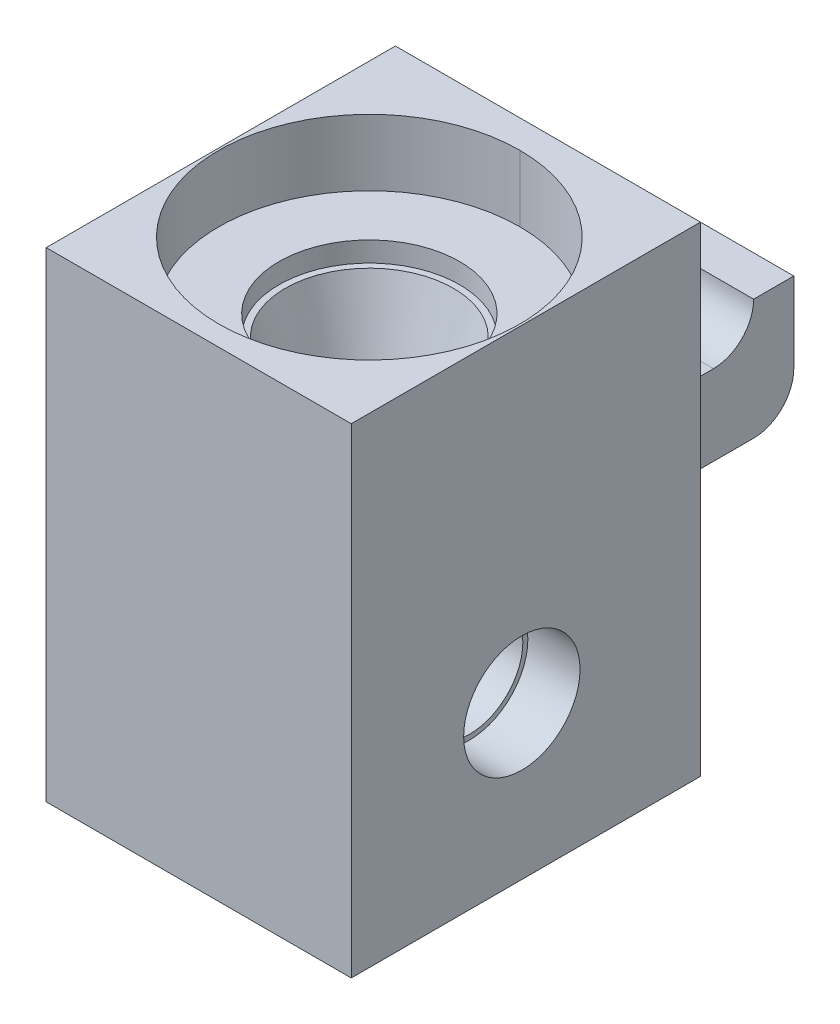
ISO-10303-21;
HEADER;
FILE_DESCRIPTION(('STEP AP214'),'2;1');
FILE_NAME('part.step','',(''),(''),'','','');
FILE_SCHEMA(('AUTOMOTIVE_DESIGN { 1 0 10303 214 1 1 1 1 }'));
ENDSEC;
DATA;
#1=APPLICATION_CONTEXT('core data for automotive mechanical design processes');
#2=APPLICATION_PROTOCOL_DEFINITION('international standard','automotive_design',2000,#1);
#3=PRODUCT_CONTEXT('',#1,'mechanical');
#4=PRODUCT('Part','Part','',(#3));
#5=PRODUCT_RELATED_PRODUCT_CATEGORY('part','',(#4));
#6=PRODUCT_DEFINITION_FORMATION('','',#4);
#7=PRODUCT_DEFINITION_CONTEXT('part definition',#1,'design');
#8=PRODUCT_DEFINITION('design','',#6,#7);
#9=PRODUCT_DEFINITION_SHAPE('','',#8);
#10=(LENGTH_UNIT() NAMED_UNIT(*) SI_UNIT(.MILLI.,.METRE.));
#11=(NAMED_UNIT(*) PLANE_ANGLE_UNIT() SI_UNIT($,.RADIAN.));
#12=(NAMED_UNIT(*) SI_UNIT($,.STERADIAN.) SOLID_ANGLE_UNIT());
#13=UNCERTAINTY_MEASURE_WITH_UNIT(LENGTH_MEASURE(1.E-05),#10,'distance_accuracy_value','');
#14=(GEOMETRIC_REPRESENTATION_CONTEXT(3) GLOBAL_UNCERTAINTY_ASSIGNED_CONTEXT((#13)) GLOBAL_UNIT_ASSIGNED_CONTEXT((#10,
#11,#12)) REPRESENTATION_CONTEXT('',''));
#15=CARTESIAN_POINT('',(0.,0.,0.));
#16=DIRECTION('',(0.,0.,1.));
#17=DIRECTION('',(1.,0.,0.));
#18=AXIS2_PLACEMENT_3D('',#15,#16,#17);
#19=CARTESIAN_POINT('',(4.25,11.92,-16.9));
#20=DIRECTION('',(0.,-1.,0.));
#21=DIRECTION('',(0.,0.,-1.));
#22=AXIS2_PLACEMENT_3D('',#19,#20,#21);
#23=PLANE('',#22);
#24=DIRECTION('',(0.,0.,1.));
#25=VECTOR('',#24,1.);
#26=CARTESIAN_POINT('',(4.25,11.92,-16.9));
#27=LINE('',#26,#25);
#28=CARTESIAN_POINT('',(4.25,11.92,-12.9));
#29=VERTEX_POINT('',#28);
#30=CARTESIAN_POINT('',(4.25,11.92,-8.90000000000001));
#31=VERTEX_POINT('',#30);
#32=EDGE_CURVE('E181',#29,#31,#27,.T.);
#33=ORIENTED_EDGE('',*,*,#32,.F.);
#34=DIRECTION('',(1.,0.,0.));
#35=VECTOR('',#34,1.);
#36=CARTESIAN_POINT('',(-4.25,11.92,-12.9));
#37=LINE('',#36,#35);
#38=CARTESIAN_POINT('',(-4.25,11.92,-12.9));
#39=VERTEX_POINT('',#38);
#40=EDGE_CURVE('E339',#29,#39,#37,.F.);
#41=ORIENTED_EDGE('',*,*,#40,.T.);
#42=DIRECTION('',(0.,0.,1.));
#43=VECTOR('',#42,1.);
#44=CARTESIAN_POINT('',(-4.25,11.92,-16.9));
#45=LINE('',#44,#43);
#46=CARTESIAN_POINT('',(-4.25,11.92,-8.90000000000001));
#47=VERTEX_POINT('',#46);
#48=EDGE_CURVE('E193',#39,#47,#45,.T.);
#49=ORIENTED_EDGE('',*,*,#48,.T.);
#50=DIRECTION('',(1.,0.,0.));
#51=VECTOR('',#50,1.);
#52=CARTESIAN_POINT('',(4.25,11.92,-8.90000000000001));
#53=LINE('',#52,#51);
#54=EDGE_CURVE('E161',#47,#31,#53,.T.);
#55=ORIENTED_EDGE('',*,*,#54,.T.);
#56=EDGE_LOOP('',(#33,#41,#49,#55));
#57=FACE_BOUND('',#56,.T.);
#58=ADVANCED_FACE('F34',(#57),#23,.F.);
#59=CARTESIAN_POINT('',(-10.,21.92,-8.90000000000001));
#60=DIRECTION('',(0.,0.,1.));
#61=DIRECTION('',(0.,-1.,0.));
#62=AXIS2_PLACEMENT_3D('',#59,#60,#61);
#63=PLANE('',#62);
#64=DIRECTION('',(1.,0.,0.));
#65=VECTOR('',#64,1.);
#66=CARTESIAN_POINT('',(-10.,-2.,-8.90000000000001));
#67=LINE('',#66,#65);
#68=CARTESIAN_POINT('',(-7.6,-2.,-8.90000000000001));
#69=VERTEX_POINT('',#68);
#70=CARTESIAN_POINT('',(7.6,-2.,-8.90000000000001));
#71=VERTEX_POINT('',#70);
#72=EDGE_CURVE('E232',#69,#71,#67,.T.);
#73=ORIENTED_EDGE('',*,*,#72,.F.);
#74=DIRECTION('',(0.,1.,0.));
#75=VECTOR('',#74,1.);
#76=CARTESIAN_POINT('',(-7.6,-2.,-8.90000000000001));
#77=LINE('',#76,#75);
#78=CARTESIAN_POINT('',(-7.6,21.92,-8.90000000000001));
#79=VERTEX_POINT('',#78);
#80=EDGE_CURVE('E207',#69,#79,#77,.T.);
#81=ORIENTED_EDGE('',*,*,#80,.T.);
#82=DIRECTION('',(1.,0.,0.));
#83=VECTOR('',#82,1.);
#84=CARTESIAN_POINT('',(-10.,21.92,-8.90000000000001));
#85=LINE('',#84,#83);
#86=CARTESIAN_POINT('',(7.6,21.92,-8.90000000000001));
#87=VERTEX_POINT('',#86);
#88=EDGE_CURVE('E229',#79,#87,#85,.T.);
#89=ORIENTED_EDGE('',*,*,#88,.T.);
#90=DIRECTION('',(0.,1.,0.));
#91=VECTOR('',#90,1.);
#92=CARTESIAN_POINT('',(7.6,-2.,-8.90000000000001));
#93=LINE('',#92,#91);
#94=EDGE_CURVE('E215',#71,#87,#93,.T.);
#95=ORIENTED_EDGE('',*,*,#94,.F.);
#96=EDGE_LOOP('',(#73,#81,#89,#95));
#97=FACE_BOUND('',#96,.T.);
#98=DIRECTION('',(0.,-1.,0.));
#99=VECTOR('',#98,1.);
#100=CARTESIAN_POINT('',(4.25,11.92,-8.90000000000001));
#101=LINE('',#100,#99);
#102=CARTESIAN_POINT('',(4.24999999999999,7.92,-8.90000000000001));
#103=VERTEX_POINT('',#102);
#104=EDGE_CURVE('E178',#31,#103,#101,.T.);
#105=ORIENTED_EDGE('',*,*,#104,.F.);
#106=ORIENTED_EDGE('',*,*,#54,.F.);
#107=DIRECTION('',(0.,1.,0.));
#108=VECTOR('',#107,1.);
#109=CARTESIAN_POINT('',(-4.25,11.92,-8.90000000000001));
#110=LINE('',#109,#108);
#111=CARTESIAN_POINT('',(-4.25000000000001,7.92,-8.90000000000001));
#112=VERTEX_POINT('',#111);
#113=EDGE_CURVE('E187',#112,#47,#110,.T.);
#114=ORIENTED_EDGE('',*,*,#113,.F.);
#115=DIRECTION('',(-1.,0.,0.));
#116=VECTOR('',#115,1.);
#117=CARTESIAN_POINT('',(4.24999999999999,7.92,-8.90000000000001));
#118=LINE('',#117,#116);
#119=EDGE_CURVE('E184',#103,#112,#118,.T.);
#120=ORIENTED_EDGE('',*,*,#119,.F.);
#121=EDGE_LOOP('',(#105,#106,#114,#120));
#122=FACE_BOUND('',#121,.T.);
#123=ADVANCED_FACE('F360',(#97,#122),#63,.F.);
#124=CARTESIAN_POINT('',(5.,5.62,0.));
#125=DIRECTION('',(1.,0.,0.));
#126=DIRECTION('',(0.,0.,-1.));
#127=AXIS2_PLACEMENT_3D('',#124,#125,#126);
#128=CONICAL_SURFACE('',#127,2.65,0.00349065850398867);
#129=CARTESIAN_POINT('',(-5.,5.62,0.));
#130=DIRECTION('',(-1.,0.,0.));
#131=DIRECTION('',(0.,0.,1.));
#132=AXIS2_PLACEMENT_3D('',#129,#130,#131);
#133=CIRCLE('',#132,2.61509327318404);
#134=CARTESIAN_POINT('',(-5.,5.62,2.61509327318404));
#135=VERTEX_POINT('',#134);
#136=EDGE_CURVE('E284',#135,#135,#133,.F.);
#137=ORIENTED_EDGE('',*,*,#136,.F.);
#138=EDGE_LOOP('',(#137));
#139=FACE_BOUND('',#138,.T.);
#140=CARTESIAN_POINT('',(5.,5.62,0.));
#141=DIRECTION('',(1.,0.,0.));
#142=DIRECTION('',(0.,0.,-1.));
#143=AXIS2_PLACEMENT_3D('',#140,#141,#142);
#144=CIRCLE('',#143,2.65);
#145=CARTESIAN_POINT('',(5.,5.62,-2.65));
#146=VERTEX_POINT('',#145);
#147=EDGE_CURVE('E285',#146,#146,#144,.T.);
#148=ORIENTED_EDGE('',*,*,#147,.T.);
#149=EDGE_LOOP('',(#148));
#150=FACE_BOUND('',#149,.T.);
#151=CARTESIAN_POINT('',(-6.7374424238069,7.62,-1.67541915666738));
#152=CARTESIAN_POINT('',(-4.99202327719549,7.62,-1.6849054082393));
#153=CARTESIAN_POINT('',(-3.24660388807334,7.62,-1.69434661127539));
#154=CARTESIAN_POINT('',(0.244235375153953,7.62,-1.71313892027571));
#155=CARTESIAN_POINT('',(1.9896552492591,7.62,-1.72249002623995));
#156=CARTESIAN_POINT('',(3.73507536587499,7.62,-1.73179608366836));
#157=B_SPLINE_CURVE_WITH_KNOTS('',3,(#151,#152,#153,#154,#155,#156),.UNSPECIFIED.,.F.,.F.,(4,2,
4),(0.,5.23633476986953,10.4726695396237),.UNSPECIFIED.);
#158=CARTESIAN_POINT('',(-1.04348592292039,7.62,-1.70620547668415));
#159=VERTEX_POINT('',#158);
#160=CARTESIAN_POINT('',(1.02510742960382,7.62,-1.71731032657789));
#161=VERTEX_POINT('',#160);
#162=EDGE_CURVE('E327',#159,#161,#157,.T.);
#163=ORIENTED_EDGE('',*,*,#162,.F.);
#164=CARTESIAN_POINT('',(-1.04309913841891,7.6198000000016,-1.70644196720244));
#165=CARTESIAN_POINT('',(-1.0938909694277,7.64608531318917,-1.67537731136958));
#166=CARTESIAN_POINT('',(-1.14309520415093,7.67291751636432,-1.64220047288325));
#167=CARTESIAN_POINT('',(-1.23826364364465,7.72696391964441,-1.57169592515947));
#168=CARTESIAN_POINT('',(-1.2842259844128,7.75417832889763,-1.53436585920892));
#169=CARTESIAN_POINT('',(-1.37309595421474,7.80843393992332,-1.45539001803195));
#170=CARTESIAN_POINT('',(-1.41598008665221,7.83547261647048,-1.41371600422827));
#171=CARTESIAN_POINT('',(-1.4981152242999,7.88851528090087,-1.32636584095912));
#172=CARTESIAN_POINT('',(-1.53736725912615,7.91451956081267,-1.28069083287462));
#173=CARTESIAN_POINT('',(-1.63755084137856,7.98212852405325,-1.15274462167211));
#174=CARTESIAN_POINT('',(-1.69493889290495,8.02223264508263,-1.06681740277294));
#175=CARTESIAN_POINT('',(-1.79662432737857,8.094654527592,-0.884845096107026));
#176=CARTESIAN_POINT('',(-1.84096239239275,8.12699642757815,-0.788832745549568));
#177=CARTESIAN_POINT('',(-1.90899888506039,8.17716533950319,-0.603303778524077));
#178=CARTESIAN_POINT('',(-1.93478831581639,8.19643707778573,-0.514951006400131));
#179=CARTESIAN_POINT('',(-1.97407361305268,8.2259287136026,-0.334047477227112));
#180=CARTESIAN_POINT('',(-1.98757130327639,8.23614995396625,-0.241497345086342));
#181=CARTESIAN_POINT('',(-2.00145324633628,8.24666337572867,-0.0546161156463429));
#182=CARTESIAN_POINT('',(-2.00180573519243,8.24693150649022,0.0397187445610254));
#183=CARTESIAN_POINT('',(-1.9892927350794,8.23745270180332,0.226988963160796));
#184=CARTESIAN_POINT('',(-1.97642608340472,8.22770488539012,0.319924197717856));
#185=CARTESIAN_POINT('',(-1.93901206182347,8.19959961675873,0.498217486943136));
#186=CARTESIAN_POINT('',(-1.9149284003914,8.18158433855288,0.583729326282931));
#187=CARTESIAN_POINT('',(-1.85645413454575,8.13838420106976,0.749189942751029));
#188=CARTESIAN_POINT('',(-1.82206181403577,8.11319814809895,0.829137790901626));
#189=CARTESIAN_POINT('',(-1.74005021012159,8.05418053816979,0.990599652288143));
#190=CARTESIAN_POINT('',(-1.6914052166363,8.01970994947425,1.07135475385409));
#191=CARTESIAN_POINT('',(-1.58452518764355,7.94603265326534,1.22391865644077));
#192=CARTESIAN_POINT('',(-1.52627830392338,7.90682011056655,1.29571620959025));
#193=CARTESIAN_POINT('',(-1.40154488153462,7.82604545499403,1.42969229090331));
#194=CARTESIAN_POINT('',(-1.33508791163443,7.78449205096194,1.49190362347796));
#195=CARTESIAN_POINT('',(-1.22974149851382,7.72218649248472,1.57790444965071));
#196=CARTESIAN_POINT('',(-1.1937401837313,7.701452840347,1.60531671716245));
#197=CARTESIAN_POINT('',(-1.11984017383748,7.66030469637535,1.65771039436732));
#198=CARTESIAN_POINT('',(-1.081941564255,7.63989019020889,1.68269191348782));
#199=CARTESIAN_POINT('',(-1.04309913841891,7.6198000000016,1.70644196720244));
#200=B_SPLINE_CURVE_WITH_KNOTS('',3,(#164,#165,#166,#167,#168,#169,#170,#171,#172,#173,#174,
#175,#176,#177,#178,#179,#180,#181,#182,#183,#184,#185,#186,#187,#188,#189,#190,#191,#192,#193,
#194,#195,#196,#197,#198,#199),.UNSPECIFIED.,.F.,.F.,(4,2,2,2,2,2,2,2,2,2,2,2,2,2,2,2,2,4),(0.,
0.195177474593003,0.390466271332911,0.58711477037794,0.783707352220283,1.11481825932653,
1.44488575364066,1.72577112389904,2.00661481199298,2.28813708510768,2.56968412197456,
2.84050431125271,3.11136960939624,3.41141141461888,3.71182626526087,4.01118909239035,
4.16042785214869,4.30965989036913),.UNSPECIFIED.);
#201=CARTESIAN_POINT('',(-1.04348592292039,7.62,1.70620547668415));
#202=VERTEX_POINT('',#201);
#203=EDGE_CURVE('E304',#159,#202,#200,.T.);
#204=ORIENTED_EDGE('',*,*,#203,.T.);
#205=CARTESIAN_POINT('',(3.73507536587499,7.62,1.73179608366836));
#206=CARTESIAN_POINT('',(1.9896552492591,7.62,1.72249002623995));
#207=CARTESIAN_POINT('',(0.244235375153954,7.62,1.71313892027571));
#208=CARTESIAN_POINT('',(-3.24660388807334,7.62,1.69434661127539));
#209=CARTESIAN_POINT('',(-4.99202327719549,7.62,1.6849054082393));
#210=CARTESIAN_POINT('',(-6.7374424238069,7.62,1.67541915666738));
#211=B_SPLINE_CURVE_WITH_KNOTS('',3,(#205,#206,#207,#208,#209,#210),.UNSPECIFIED.,.F.,.F.,(4,2,
4),(0.,5.23633476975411,10.4726695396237),.UNSPECIFIED.);
#212=CARTESIAN_POINT('',(1.02510742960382,7.62,1.71731032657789));
#213=VERTEX_POINT('',#212);
#214=EDGE_CURVE('E291',#213,#202,#211,.T.);
#215=ORIENTED_EDGE('',*,*,#214,.F.);
#216=CARTESIAN_POINT('',(1.02472064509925,7.6198,1.71754114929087));
#217=CARTESIAN_POINT('',(1.07604957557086,7.64636367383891,1.68689977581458));
#218=CARTESIAN_POINT('',(1.12578985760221,7.67350249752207,1.65411945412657));
#219=CARTESIAN_POINT('',(1.22203155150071,7.72820863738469,1.58435775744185));
#220=CARTESIAN_POINT('',(1.26853118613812,7.7557761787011,1.54737410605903));
#221=CARTESIAN_POINT('',(1.35848597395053,7.81077821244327,1.46904445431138));
#222=CARTESIAN_POINT('',(1.40191768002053,7.83821044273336,1.42766987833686));
#223=CARTESIAN_POINT('',(1.48515807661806,7.89207202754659,1.34086648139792));
#224=CARTESIAN_POINT('',(1.52496776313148,7.9185016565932,1.29543878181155));
#225=CARTESIAN_POINT('',(1.62668733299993,7.98730298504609,1.16805400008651));
#226=CARTESIAN_POINT('',(1.68506149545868,8.02819689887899,1.08238586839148));
#227=CARTESIAN_POINT('',(1.78873572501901,8.10223346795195,0.900726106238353));
#228=CARTESIAN_POINT('',(1.83407632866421,8.13540009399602,0.804767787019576));
#229=CARTESIAN_POINT('',(1.90382719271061,8.18698909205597,0.619431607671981));
#230=CARTESIAN_POINT('',(1.93037262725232,8.20688716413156,0.531274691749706));
#231=CARTESIAN_POINT('',(1.9712039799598,8.23764015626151,0.350598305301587));
#232=CARTESIAN_POINT('',(1.98549200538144,8.24849663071,0.25807958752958));
#233=CARTESIAN_POINT('',(2.00094332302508,8.26024122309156,0.0710608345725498));
#234=CARTESIAN_POINT('',(2.00207211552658,8.26110313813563,-0.0234437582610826));
#235=CARTESIAN_POINT('',(1.99103903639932,8.25271091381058,-0.211212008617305));
#236=CARTESIAN_POINT('',(1.97887614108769,8.2434559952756,-0.304475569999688));
#237=CARTESIAN_POINT('',(1.94281373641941,8.21623718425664,-0.483155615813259));
#238=CARTESIAN_POINT('',(1.91942928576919,8.19865588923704,-0.568737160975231));
#239=CARTESIAN_POINT('',(1.86233597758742,8.1562378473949,-0.734432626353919));
#240=CARTESIAN_POINT('',(1.82862592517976,8.13140026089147,-0.814545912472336));
#241=CARTESIAN_POINT('',(1.74818042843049,8.07311108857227,-0.976134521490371));
#242=CARTESIAN_POINT('',(1.70045581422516,8.03903278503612,-1.0568871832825));
#243=CARTESIAN_POINT('',(1.59546976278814,7.96600810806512,-1.20958025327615));
#244=CARTESIAN_POINT('',(1.53819494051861,7.92705492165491,-1.28150804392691));
#245=CARTESIAN_POINT('',(1.41045622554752,7.84331223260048,-1.42136212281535));
#246=CARTESIAN_POINT('',(1.3393117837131,7.79830450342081,-1.48853774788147));
#247=CARTESIAN_POINT('',(1.22610110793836,7.73075083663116,-1.58083443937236));
#248=CARTESIAN_POINT('',(1.18734457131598,7.7082595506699,-1.61015138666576));
#249=CARTESIAN_POINT('',(1.10765949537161,7.66364963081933,-1.66596771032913));
#250=CARTESIAN_POINT('',(1.06673123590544,7.64153094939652,-1.69246744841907));
#251=CARTESIAN_POINT('',(1.02472064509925,7.6198,-1.71754114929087));
#252=B_SPLINE_CURVE_WITH_KNOTS('',3,(#216,#217,#218,#219,#220,#221,#222,#223,#224,#225,#226,
#227,#228,#229,#230,#231,#232,#233,#234,#235,#236,#237,#238,#239,#240,#241,#242,#243,#244,#245,
#246,#247,#248,#249,#250,#251),.UNSPECIFIED.,.F.,.F.,(4,2,2,2,2,2,2,2,2,2,2,2,2,2,2,2,2,4),(0.,
0.19617362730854,0.392454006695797,0.590100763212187,0.787693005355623,1.12060337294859,
1.45246684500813,1.73382610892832,2.01513699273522,2.29718522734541,2.57925518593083,
2.8494634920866,3.11970307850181,3.41800883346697,3.7167362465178,4.03878278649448,
4.19932731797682,4.35985121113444),.UNSPECIFIED.);
#253=EDGE_CURVE('E333',#213,#161,#252,.T.);
#254=ORIENTED_EDGE('',*,*,#253,.T.);
#255=EDGE_LOOP('',(#163,#204,#215,#254));
#256=FACE_BOUND('',#255,.T.);
#257=ADVANCED_FACE('F310',(#139,#150,#256),#128,.F.);
#258=CARTESIAN_POINT('',(0.,17.62,0.));
#259=DIRECTION('',(0.,1.,0.));
#260=DIRECTION('',(0.,0.,1.));
#261=AXIS2_PLACEMENT_3D('',#258,#259,#260);
#262=CYLINDRICAL_SURFACE('',#261,4.5);
#263=CARTESIAN_POINT('',(0.,17.62,0.));
#264=DIRECTION('',(0.,1.,0.));
#265=DIRECTION('',(0.,0.,1.));
#266=AXIS2_PLACEMENT_3D('',#263,#264,#265);
#267=CIRCLE('',#266,4.5);
#268=CARTESIAN_POINT('',(0.,17.62,4.5));
#269=VERTEX_POINT('',#268);
#270=EDGE_CURVE('E277',#269,#269,#267,.T.);
#271=ORIENTED_EDGE('',*,*,#270,.F.);
#272=EDGE_LOOP('',(#271));
#273=FACE_BOUND('',#272,.T.);
#274=CARTESIAN_POINT('',(0.,18.62,0.));
#275=DIRECTION('',(0.,1.,0.));
#276=DIRECTION('',(0.,0.,1.));
#277=AXIS2_PLACEMENT_3D('',#274,#275,#276);
#278=CIRCLE('',#277,4.5);
#279=CARTESIAN_POINT('',(0.,18.62,4.5));
#280=VERTEX_POINT('',#279);
#281=EDGE_CURVE('E268',#280,#280,#278,.F.);
#282=ORIENTED_EDGE('',*,*,#281,.F.);
#283=EDGE_LOOP('',(#282));
#284=FACE_BOUND('',#283,.T.);
#285=ADVANCED_FACE('F433',(#273,#284),#262,.F.);
#286=CARTESIAN_POINT('',(0.,3.00490672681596,0.));
#287=DIRECTION('',(0.,1.,0.));
#288=DIRECTION('',(0.,0.,1.));
#289=AXIS2_PLACEMENT_3D('',#286,#287,#288);
#290=CONICAL_SURFACE('',#289,0.,0.279252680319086);
#291=CARTESIAN_POINT('',(0.,9.97973561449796,0.));
#292=DIRECTION('',(0.,1.,0.));
#293=DIRECTION('',(0.,0.,1.));
#294=AXIS2_PLACEMENT_3D('',#291,#292,#293);
#295=CIRCLE('',#294,2.);
#296=CARTESIAN_POINT('',(0.,9.97973561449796,2.));
#297=VERTEX_POINT('',#296);
#298=EDGE_CURVE('E249',#297,#297,#295,.T.);
#299=ORIENTED_EDGE('',*,*,#298,.F.);
#300=EDGE_LOOP('',(#299));
#301=FACE_BOUND('',#300,.T.);
#302=CARTESIAN_POINT('',(0.,17.62,0.));
#303=DIRECTION('',(0.,1.,0.));
#304=DIRECTION('',(0.,0.,1.));
#305=AXIS2_PLACEMENT_3D('',#302,#303,#304);
#306=CIRCLE('',#305,4.19081055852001);
#307=CARTESIAN_POINT('',(0.,17.62,4.19081055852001));
#308=VERTEX_POINT('',#307);
#309=EDGE_CURVE('E280',#308,#308,#306,.T.);
#310=ORIENTED_EDGE('',*,*,#309,.T.);
#311=EDGE_LOOP('',(#310));
#312=FACE_BOUND('',#311,.T.);
#313=ADVANCED_FACE('F416',(#301,#312),#290,.F.);
#314=CARTESIAN_POINT('',(5.,5.62,0.));
#315=DIRECTION('',(1.,0.,0.));
#316=DIRECTION('',(0.,0.,-1.));
#317=AXIS2_PLACEMENT_3D('',#314,#315,#316);
#318=CYLINDRICAL_SURFACE('',#317,2.9);
#319=CARTESIAN_POINT('',(7.6,5.62,0.));
#320=DIRECTION('',(-1.,0.,0.));
#321=DIRECTION('',(0.,0.,1.));
#322=AXIS2_PLACEMENT_3D('',#319,#320,#321);
#323=CIRCLE('',#322,2.9);
#324=CARTESIAN_POINT('',(7.6,5.62,2.9));
#325=VERTEX_POINT('',#324);
#326=EDGE_CURVE('E210',#325,#325,#323,.F.);
#327=ORIENTED_EDGE('',*,*,#326,.T.);
#328=EDGE_LOOP('',(#327));
#329=FACE_BOUND('',#328,.T.);
#330=CARTESIAN_POINT('',(5.,5.62,0.));
#331=DIRECTION('',(1.,0.,0.));
#332=DIRECTION('',(0.,0.,-1.));
#333=AXIS2_PLACEMENT_3D('',#330,#331,#332);
#334=CIRCLE('',#333,2.9);
#335=CARTESIAN_POINT('',(5.,5.62,-2.9));
#336=VERTEX_POINT('',#335);
#337=EDGE_CURVE('E288',#336,#336,#334,.T.);
#338=ORIENTED_EDGE('',*,*,#337,.F.);
#339=EDGE_LOOP('',(#338));
#340=FACE_BOUND('',#339,.T.);
#341=ADVANCED_FACE('F412',(#329,#340),#318,.F.);
#342=CARTESIAN_POINT('',(5.,5.62,0.));
#343=DIRECTION('',(1.,0.,0.));
#344=DIRECTION('',(0.,0.,-1.));
#345=AXIS2_PLACEMENT_3D('',#342,#343,#344);
#346=PLANE('',#345);
#347=ORIENTED_EDGE('',*,*,#147,.F.);
#348=EDGE_LOOP('',(#347));
#349=FACE_BOUND('',#348,.T.);
#350=ORIENTED_EDGE('',*,*,#337,.T.);
#351=EDGE_LOOP('',(#350));
#352=FACE_BOUND('',#351,.T.);
#353=ADVANCED_FACE('F415',(#349,#352),#346,.T.);
#354=CARTESIAN_POINT('',(-5.,5.62,0.));
#355=DIRECTION('',(-1.,0.,0.));
#356=DIRECTION('',(0.,0.,1.));
#357=AXIS2_PLACEMENT_3D('',#354,#355,#356);
#358=PLANE('',#357);
#359=CARTESIAN_POINT('',(-5.,5.62,0.));
#360=DIRECTION('',(-1.,0.,0.));
#361=DIRECTION('',(0.,0.,1.));
#362=AXIS2_PLACEMENT_3D('',#359,#360,#361);
#363=CIRCLE('',#362,2.8);
#364=CARTESIAN_POINT('',(-5.,5.62,2.8));
#365=VERTEX_POINT('',#364);
#366=EDGE_CURVE('E281',#365,#365,#363,.T.);
#367=ORIENTED_EDGE('',*,*,#366,.T.);
#368=EDGE_LOOP('',(#367));
#369=FACE_BOUND('',#368,.T.);
#370=ORIENTED_EDGE('',*,*,#136,.T.);
#371=EDGE_LOOP('',(#370));
#372=FACE_BOUND('',#371,.T.);
#373=ADVANCED_FACE('F421',(#369,#372),#358,.T.);
#374=CARTESIAN_POINT('',(-5.,5.62,0.));
#375=DIRECTION('',(-1.,0.,0.));
#376=DIRECTION('',(0.,0.,1.));
#377=AXIS2_PLACEMENT_3D('',#374,#375,#376);
#378=CYLINDRICAL_SURFACE('',#377,2.8);
#379=CARTESIAN_POINT('',(-7.6,5.62,0.));
#380=DIRECTION('',(1.,0.,0.));
#381=DIRECTION('',(0.,0.,-1.));
#382=AXIS2_PLACEMENT_3D('',#379,#380,#381);
#383=CIRCLE('',#382,2.8);
#384=CARTESIAN_POINT('',(-7.6,5.62,-2.8));
#385=VERTEX_POINT('',#384);
#386=EDGE_CURVE('E222',#385,#385,#383,.F.);
#387=ORIENTED_EDGE('',*,*,#386,.T.);
#388=EDGE_LOOP('',(#387));
#389=FACE_BOUND('',#388,.T.);
#390=ORIENTED_EDGE('',*,*,#366,.F.);
#391=EDGE_LOOP('',(#390));
#392=FACE_BOUND('',#391,.T.);
#393=ADVANCED_FACE('F426',(#389,#392),#378,.F.);
#394=CARTESIAN_POINT('',(0.,17.62,0.));
#395=DIRECTION('',(0.,1.,0.));
#396=DIRECTION('',(0.,0.,1.));
#397=AXIS2_PLACEMENT_3D('',#394,#395,#396);
#398=PLANE('',#397);
#399=ORIENTED_EDGE('',*,*,#309,.F.);
#400=EDGE_LOOP('',(#399));
#401=FACE_BOUND('',#400,.T.);
#402=ORIENTED_EDGE('',*,*,#270,.T.);
#403=EDGE_LOOP('',(#402));
#404=FACE_BOUND('',#403,.T.);
#405=ADVANCED_FACE('F579',(#401,#404),#398,.T.);
#406=CARTESIAN_POINT('',(-0.000500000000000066,18.62,0.));
#407=DIRECTION('',(0.,1.,0.));
#408=DIRECTION('',(0.,0.,1.));
#409=AXIS2_PLACEMENT_3D('',#406,#407,#408);
#410=PLANE('',#409);
#411=CARTESIAN_POINT('',(-0.000500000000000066,18.62,0.));
#412=DIRECTION('',(0.,1.,0.));
#413=DIRECTION('',(0.,0.,1.));
#414=AXIS2_PLACEMENT_3D('',#411,#412,#413);
#415=CIRCLE('',#414,7.5);
#416=CARTESIAN_POINT('',(-0.000500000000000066,18.62,-7.5));
#417=VERTEX_POINT('',#416);
#418=CARTESIAN_POINT('',(-0.000500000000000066,18.62,7.5));
#419=VERTEX_POINT('',#418);
#420=EDGE_CURVE('E252',#417,#419,#415,.T.);
#421=ORIENTED_EDGE('',*,*,#420,.T.);
#422=DIRECTION('',(1.,0.,0.));
#423=VECTOR('',#422,1.);
#424=CARTESIAN_POINT('',(-0.000500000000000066,18.62,7.5));
#425=LINE('',#424,#423);
#426=CARTESIAN_POINT('',(0.000500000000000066,18.62,7.5));
#427=VERTEX_POINT('',#426);
#428=EDGE_CURVE('E255',#419,#427,#425,.T.);
#429=ORIENTED_EDGE('',*,*,#428,.T.);
#430=CARTESIAN_POINT('',(0.000500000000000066,18.62,0.));
#431=DIRECTION('',(0.,1.,0.));
#432=DIRECTION('',(0.,0.,1.));
#433=AXIS2_PLACEMENT_3D('',#430,#431,#432);
#434=CIRCLE('',#433,7.5);
#435=CARTESIAN_POINT('',(0.000500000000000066,18.62,-7.5));
#436=VERTEX_POINT('',#435);
#437=EDGE_CURVE('E258',#427,#436,#434,.T.);
#438=ORIENTED_EDGE('',*,*,#437,.T.);
#439=DIRECTION('',(-1.,0.,0.));
#440=VECTOR('',#439,1.);
#441=CARTESIAN_POINT('',(-0.000500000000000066,18.62,-7.5));
#442=LINE('',#441,#440);
#443=EDGE_CURVE('E261',#436,#417,#442,.T.);
#444=ORIENTED_EDGE('',*,*,#443,.T.);
#445=EDGE_LOOP('',(#421,#429,#438,#444));
#446=FACE_BOUND('',#445,.T.);
#447=ORIENTED_EDGE('',*,*,#281,.T.);
#448=EDGE_LOOP('',(#447));
#449=FACE_BOUND('',#448,.T.);
#450=ADVANCED_FACE('F590',(#446,#449),#410,.T.);
#451=CARTESIAN_POINT('',(-0.000500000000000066,18.62,0.));
#452=DIRECTION('',(0.,1.,0.));
#453=DIRECTION('',(0.,0.,1.));
#454=AXIS2_PLACEMENT_3D('',#451,#452,#453);
#455=CYLINDRICAL_SURFACE('',#454,7.5);
#456=DIRECTION('',(0.,1.,0.));
#457=VECTOR('',#456,1.);
#458=CARTESIAN_POINT('',(-0.000500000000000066,18.62,-7.5));
#459=LINE('',#458,#457);
#460=CARTESIAN_POINT('',(-0.000500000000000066,21.92,-7.5));
#461=VERTEX_POINT('',#460);
#462=EDGE_CURVE('E265',#417,#461,#459,.T.);
#463=ORIENTED_EDGE('',*,*,#462,.T.);
#464=CARTESIAN_POINT('',(-0.000500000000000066,21.92,0.));
#465=DIRECTION('',(0.,-1.,0.));
#466=DIRECTION('',(0.,0.,-1.));
#467=AXIS2_PLACEMENT_3D('',#464,#465,#466);
#468=CIRCLE('',#467,7.5);
#469=CARTESIAN_POINT('',(-0.000500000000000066,21.92,7.5));
#470=VERTEX_POINT('',#469);
#471=EDGE_CURVE('E243',#461,#470,#468,.F.);
#472=ORIENTED_EDGE('',*,*,#471,.T.);
#473=DIRECTION('',(0.,1.,0.));
#474=VECTOR('',#473,1.);
#475=CARTESIAN_POINT('',(-0.000500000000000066,18.62,7.5));
#476=LINE('',#475,#474);
#477=EDGE_CURVE('E264',#419,#470,#476,.T.);
#478=ORIENTED_EDGE('',*,*,#477,.F.);
#479=ORIENTED_EDGE('',*,*,#420,.F.);
#480=EDGE_LOOP('',(#463,#472,#478,#479));
#481=FACE_BOUND('',#480,.T.);
#482=ADVANCED_FACE('F597',(#481),#455,.F.);
#483=CARTESIAN_POINT('',(-0.000500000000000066,18.62,-7.5));
#484=DIRECTION('',(0.,0.,-1.));
#485=DIRECTION('',(-1.,0.,0.));
#486=AXIS2_PLACEMENT_3D('',#483,#484,#485);
#487=PLANE('',#486);
#488=DIRECTION('',(0.,1.,0.));
#489=VECTOR('',#488,1.);
#490=CARTESIAN_POINT('',(0.000500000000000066,18.62,-7.5));
#491=LINE('',#490,#489);
#492=CARTESIAN_POINT('',(0.000500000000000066,21.92,-7.5));
#493=VERTEX_POINT('',#492);
#494=EDGE_CURVE('E269',#436,#493,#491,.T.);
#495=ORIENTED_EDGE('',*,*,#494,.T.);
#496=DIRECTION('',(-1.,0.,0.));
#497=VECTOR('',#496,1.);
#498=CARTESIAN_POINT('',(-0.000500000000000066,21.92,-7.5));
#499=LINE('',#498,#497);
#500=EDGE_CURVE('E240',#493,#461,#499,.T.);
#501=ORIENTED_EDGE('',*,*,#500,.T.);
#502=ORIENTED_EDGE('',*,*,#462,.F.);
#503=ORIENTED_EDGE('',*,*,#443,.F.);
#504=EDGE_LOOP('',(#495,#501,#502,#503));
#505=FACE_BOUND('',#504,.T.);
#506=ADVANCED_FACE('F604',(#505),#487,.F.);
#507=CARTESIAN_POINT('',(0.000500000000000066,18.62,0.));
#508=DIRECTION('',(0.,1.,0.));
#509=DIRECTION('',(0.,0.,1.));
#510=AXIS2_PLACEMENT_3D('',#507,#508,#509);
#511=CYLINDRICAL_SURFACE('',#510,7.5);
#512=DIRECTION('',(0.,1.,0.));
#513=VECTOR('',#512,1.);
#514=CARTESIAN_POINT('',(0.000500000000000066,18.62,7.5));
#515=LINE('',#514,#513);
#516=CARTESIAN_POINT('',(0.000500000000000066,21.92,7.5));
#517=VERTEX_POINT('',#516);
#518=EDGE_CURVE('E272',#427,#517,#515,.T.);
#519=ORIENTED_EDGE('',*,*,#518,.T.);
#520=CARTESIAN_POINT('',(0.000500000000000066,21.92,0.));
#521=DIRECTION('',(0.,-1.,0.));
#522=DIRECTION('',(0.,0.,-1.));
#523=AXIS2_PLACEMENT_3D('',#520,#521,#522);
#524=CIRCLE('',#523,7.5);
#525=EDGE_CURVE('E235',#517,#493,#524,.F.);
#526=ORIENTED_EDGE('',*,*,#525,.T.);
#527=ORIENTED_EDGE('',*,*,#494,.F.);
#528=ORIENTED_EDGE('',*,*,#437,.F.);
#529=EDGE_LOOP('',(#519,#526,#527,#528));
#530=FACE_BOUND('',#529,.T.);
#531=ADVANCED_FACE('F612',(#530),#511,.F.);
#532=CARTESIAN_POINT('',(-0.000500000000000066,18.62,7.5));
#533=DIRECTION('',(0.,0.,1.));
#534=DIRECTION('',(1.,0.,0.));
#535=AXIS2_PLACEMENT_3D('',#532,#533,#534);
#536=PLANE('',#535);
#537=ORIENTED_EDGE('',*,*,#477,.T.);
#538=DIRECTION('',(1.,0.,0.));
#539=VECTOR('',#538,1.);
#540=CARTESIAN_POINT('',(-0.000500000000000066,21.92,7.5));
#541=LINE('',#540,#539);
#542=EDGE_CURVE('E332',#470,#517,#541,.T.);
#543=ORIENTED_EDGE('',*,*,#542,.T.);
#544=ORIENTED_EDGE('',*,*,#518,.F.);
#545=ORIENTED_EDGE('',*,*,#428,.F.);
#546=EDGE_LOOP('',(#537,#543,#544,#545));
#547=FACE_BOUND('',#546,.T.);
#548=ADVANCED_FACE('F571',(#547),#536,.F.);
#549=CARTESIAN_POINT('',(0.,-2.,0.));
#550=DIRECTION('',(0.,-1.,0.));
#551=DIRECTION('',(0.,0.,-1.));
#552=AXIS2_PLACEMENT_3D('',#549,#550,#551);
#553=PLANE('',#552);
#554=DIRECTION('',(0.,0.,-1.));
#555=VECTOR('',#554,1.);
#556=CARTESIAN_POINT('',(-7.6,-2.,-8.90000000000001));
#557=LINE('',#556,#555);
#558=CARTESIAN_POINT('',(-7.6,-2.,8.49999999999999));
#559=VERTEX_POINT('',#558);
#560=EDGE_CURVE('E200',#559,#69,#557,.T.);
#561=ORIENTED_EDGE('',*,*,#560,.T.);
#562=ORIENTED_EDGE('',*,*,#72,.T.);
#563=DIRECTION('',(0.,0.,1.));
#564=VECTOR('',#563,1.);
#565=CARTESIAN_POINT('',(7.6,-2.,-8.90000000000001));
#566=LINE('',#565,#564);
#567=CARTESIAN_POINT('',(7.6,-2.,8.5));
#568=VERTEX_POINT('',#567);
#569=EDGE_CURVE('E212',#71,#568,#566,.T.);
#570=ORIENTED_EDGE('',*,*,#569,.T.);
#571=DIRECTION('',(1.,0.,0.));
#572=VECTOR('',#571,1.);
#573=CARTESIAN_POINT('',(-10.,-2.,8.49999999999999));
#574=LINE('',#573,#572);
#575=EDGE_CURVE('E225',#559,#568,#574,.T.);
#576=ORIENTED_EDGE('',*,*,#575,.F.);
#577=EDGE_LOOP('',(#561,#562,#570,#576));
#578=FACE_BOUND('',#577,.T.);
#579=ADVANCED_FACE('F408',(#578),#553,.T.);
#580=CARTESIAN_POINT('',(0.,7.62,0.));
#581=DIRECTION('',(0.,1.,0.));
#582=DIRECTION('',(0.,0.,1.));
#583=AXIS2_PLACEMENT_3D('',#580,#581,#582);
#584=CYLINDRICAL_SURFACE('',#583,2.);
#585=ORIENTED_EDGE('',*,*,#298,.T.);
#586=EDGE_LOOP('',(#585));
#587=FACE_BOUND('',#586,.T.);
#588=CARTESIAN_POINT('',(0.,7.62,0.));
#589=DIRECTION('',(0.,1.,0.));
#590=DIRECTION('',(0.,0.,1.));
#591=AXIS2_PLACEMENT_3D('',#588,#589,#590);
#592=CIRCLE('',#591,2.);
#593=EDGE_CURVE('E246',#202,#213,#592,.T.);
#594=ORIENTED_EDGE('',*,*,#593,.F.);
#595=ORIENTED_EDGE('',*,*,#203,.F.);
#596=EDGE_CURVE('E248',#161,#159,#592,.T.);
#597=ORIENTED_EDGE('',*,*,#596,.F.);
#598=ORIENTED_EDGE('',*,*,#253,.F.);
#599=EDGE_LOOP('',(#594,#595,#597,#598));
#600=FACE_BOUND('',#599,.T.);
#601=ADVANCED_FACE('F319',(#587,#600),#584,.F.);
#602=CARTESIAN_POINT('',(0.,7.62,0.));
#603=DIRECTION('',(0.,1.,0.));
#604=DIRECTION('',(0.,0.,1.));
#605=AXIS2_PLACEMENT_3D('',#602,#603,#604);
#606=PLANE('',#605);
#607=ORIENTED_EDGE('',*,*,#162,.T.);
#608=ORIENTED_EDGE('',*,*,#596,.T.);
#609=EDGE_LOOP('',(#607,#608));
#610=FACE_BOUND('',#609,.T.);
#611=ADVANCED_FACE('F314',(#610),#606,.T.);
#612=ORIENTED_EDGE('',*,*,#214,.T.);
#613=ORIENTED_EDGE('',*,*,#593,.T.);
#614=EDGE_LOOP('',(#612,#613));
#615=FACE_BOUND('',#614,.T.);
#616=ADVANCED_FACE('F318',(#615),#606,.T.);
#617=CARTESIAN_POINT('',(-10.,21.92,12.5));
#618=DIRECTION('',(0.,-1.,0.));
#619=DIRECTION('',(0.,0.,-1.));
#620=AXIS2_PLACEMENT_3D('',#617,#618,#619);
#621=PLANE('',#620);
#622=ORIENTED_EDGE('',*,*,#88,.F.);
#623=DIRECTION('',(0.,0.,-1.));
#624=VECTOR('',#623,1.);
#625=CARTESIAN_POINT('',(-7.6,21.92,-8.90000000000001));
#626=LINE('',#625,#624);
#627=CARTESIAN_POINT('',(-7.6,21.92,8.5));
#628=VERTEX_POINT('',#627);
#629=EDGE_CURVE('E204',#628,#79,#626,.T.);
#630=ORIENTED_EDGE('',*,*,#629,.F.);
#631=DIRECTION('',(1.,0.,0.));
#632=VECTOR('',#631,1.);
#633=CARTESIAN_POINT('',(-10.,21.92,8.5));
#634=LINE('',#633,#632);
#635=CARTESIAN_POINT('',(7.6,21.92,8.5));
#636=VERTEX_POINT('',#635);
#637=EDGE_CURVE('E226',#628,#636,#634,.T.);
#638=ORIENTED_EDGE('',*,*,#637,.T.);
#639=DIRECTION('',(0.,0.,1.));
#640=VECTOR('',#639,1.);
#641=CARTESIAN_POINT('',(7.6,21.92,-8.90000000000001));
#642=LINE('',#641,#640);
#643=EDGE_CURVE('E199',#87,#636,#642,.T.);
#644=ORIENTED_EDGE('',*,*,#643,.F.);
#645=EDGE_LOOP('',(#622,#630,#638,#644));
#646=FACE_BOUND('',#645,.T.);
#647=ORIENTED_EDGE('',*,*,#500,.F.);
#648=ORIENTED_EDGE('',*,*,#525,.F.);
#649=ORIENTED_EDGE('',*,*,#542,.F.);
#650=ORIENTED_EDGE('',*,*,#471,.F.);
#651=EDGE_LOOP('',(#647,#648,#649,#650));
#652=FACE_BOUND('',#651,.T.);
#653=ADVANCED_FACE('F321',(#646,#652),#621,.F.);
#654=CARTESIAN_POINT('',(-10.,21.92,8.5));
#655=DIRECTION('',(0.,0.,-1.));
#656=DIRECTION('',(0.,1.,0.));
#657=AXIS2_PLACEMENT_3D('',#654,#655,#656);
#658=PLANE('',#657);
#659=ORIENTED_EDGE('',*,*,#637,.F.);
#660=DIRECTION('',(0.,1.,0.));
#661=VECTOR('',#660,1.);
#662=CARTESIAN_POINT('',(-7.6,-2.,8.5));
#663=LINE('',#662,#661);
#664=EDGE_CURVE('E203',#559,#628,#663,.T.);
#665=ORIENTED_EDGE('',*,*,#664,.F.);
#666=ORIENTED_EDGE('',*,*,#575,.T.);
#667=DIRECTION('',(0.,1.,0.));
#668=VECTOR('',#667,1.);
#669=CARTESIAN_POINT('',(7.6,-2.,8.5));
#670=LINE('',#669,#668);
#671=EDGE_CURVE('E206',#568,#636,#670,.T.);
#672=ORIENTED_EDGE('',*,*,#671,.T.);
#673=EDGE_LOOP('',(#659,#665,#666,#672));
#674=FACE_BOUND('',#673,.T.);
#675=ADVANCED_FACE('F389',(#674),#658,.F.);
#676=CARTESIAN_POINT('',(7.6,-2.,-8.90000000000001));
#677=DIRECTION('',(-1.,0.,0.));
#678=DIRECTION('',(0.,0.,1.));
#679=AXIS2_PLACEMENT_3D('',#676,#677,#678);
#680=PLANE('',#679);
#681=ORIENTED_EDGE('',*,*,#643,.T.);
#682=ORIENTED_EDGE('',*,*,#671,.F.);
#683=ORIENTED_EDGE('',*,*,#569,.F.);
#684=ORIENTED_EDGE('',*,*,#94,.T.);
#685=EDGE_LOOP('',(#681,#682,#683,#684));
#686=FACE_BOUND('',#685,.T.);
#687=ORIENTED_EDGE('',*,*,#326,.F.);
#688=EDGE_LOOP('',(#687));
#689=FACE_BOUND('',#688,.T.);
#690=ADVANCED_FACE('F385',(#686,#689),#680,.F.);
#691=CARTESIAN_POINT('',(-7.6,-2.,-8.90000000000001));
#692=DIRECTION('',(1.,0.,0.));
#693=DIRECTION('',(0.,0.,-1.));
#694=AXIS2_PLACEMENT_3D('',#691,#692,#693);
#695=PLANE('',#694);
#696=ORIENTED_EDGE('',*,*,#629,.T.);
#697=ORIENTED_EDGE('',*,*,#80,.F.);
#698=ORIENTED_EDGE('',*,*,#560,.F.);
#699=ORIENTED_EDGE('',*,*,#664,.T.);
#700=EDGE_LOOP('',(#696,#697,#698,#699));
#701=FACE_BOUND('',#700,.T.);
#702=ORIENTED_EDGE('',*,*,#386,.F.);
#703=EDGE_LOOP('',(#702));
#704=FACE_BOUND('',#703,.T.);
#705=ADVANCED_FACE('F382',(#701,#704),#695,.F.);
#706=CARTESIAN_POINT('',(4.25,11.92,-16.9));
#707=DIRECTION('',(-1.,0.,0.));
#708=DIRECTION('',(0.,-1.,0.));
#709=AXIS2_PLACEMENT_3D('',#706,#707,#708);
#710=PLANE('',#709);
#711=DIRECTION('',(0.,0.,1.));
#712=VECTOR('',#711,1.);
#713=CARTESIAN_POINT('',(4.24999999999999,7.92000000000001,-16.9));
#714=LINE('',#713,#712);
#715=CARTESIAN_POINT('',(4.24999999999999,7.92000000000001,-14.9));
#716=VERTEX_POINT('',#715);
#717=EDGE_CURVE('E197',#716,#103,#714,.T.);
#718=ORIENTED_EDGE('',*,*,#717,.F.);
#719=CARTESIAN_POINT('',(4.25,9.92000000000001,-14.9));
#720=DIRECTION('',(-1.,0.,0.));
#721=DIRECTION('',(0.,-1.,0.));
#722=AXIS2_PLACEMENT_3D('',#719,#720,#721);
#723=CIRCLE('',#722,2.);
#724=CARTESIAN_POINT('',(4.25,9.92000000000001,-16.9));
#725=VERTEX_POINT('',#724);
#726=EDGE_CURVE('E11',#716,#725,#723,.F.);
#727=ORIENTED_EDGE('',*,*,#726,.T.);
#728=DIRECTION('',(0.,-1.,0.));
#729=VECTOR('',#728,1.);
#730=CARTESIAN_POINT('',(4.25,11.92,-16.9));
#731=LINE('',#730,#729);
#732=CARTESIAN_POINT('',(4.25,13.92,-16.9));
#733=VERTEX_POINT('',#732);
#734=EDGE_CURVE('E151',#733,#725,#731,.T.);
#735=ORIENTED_EDGE('',*,*,#734,.F.);
#736=DIRECTION('',(0.,0.,-1.));
#737=VECTOR('',#736,1.);
#738=CARTESIAN_POINT('',(4.25,13.92,-16.9));
#739=LINE('',#738,#737);
#740=CARTESIAN_POINT('',(4.25,13.92,-14.9));
#741=VERTEX_POINT('',#740);
#742=EDGE_CURVE('E155',#741,#733,#739,.T.);
#743=ORIENTED_EDGE('',*,*,#742,.F.);
#744=CARTESIAN_POINT('',(4.25,13.92,-12.9));
#745=DIRECTION('',(-1.,0.,0.));
#746=DIRECTION('',(0.,-1.,0.));
#747=AXIS2_PLACEMENT_3D('',#744,#745,#746);
#748=CIRCLE('',#747,2.);
#749=EDGE_CURVE('E341',#741,#29,#748,.T.);
#750=ORIENTED_EDGE('',*,*,#749,.T.);
#751=ORIENTED_EDGE('',*,*,#32,.T.);
#752=ORIENTED_EDGE('',*,*,#104,.T.);
#753=EDGE_LOOP('',(#718,#727,#735,#743,#750,#751,#752));
#754=FACE_BOUND('',#753,.T.);
#755=ADVANCED_FACE('F153',(#754),#710,.F.);
#756=CARTESIAN_POINT('',(4.24999999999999,7.92000000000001,-16.9));
#757=DIRECTION('',(0.,1.,0.));
#758=DIRECTION('',(0.,0.,1.));
#759=AXIS2_PLACEMENT_3D('',#756,#757,#758);
#760=PLANE('',#759);
#761=DIRECTION('',(0.,0.,1.));
#762=VECTOR('',#761,1.);
#763=CARTESIAN_POINT('',(-4.25000000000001,7.92000000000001,-16.9));
#764=LINE('',#763,#762);
#765=CARTESIAN_POINT('',(-4.25000000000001,7.92000000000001,-14.9));
#766=VERTEX_POINT('',#765);
#767=EDGE_CURVE('E195',#766,#112,#764,.T.);
#768=ORIENTED_EDGE('',*,*,#767,.F.);
#769=DIRECTION('',(-1.,0.,0.));
#770=VECTOR('',#769,1.);
#771=CARTESIAN_POINT('',(4.24999999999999,7.92000000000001,-14.9));
#772=LINE('',#771,#770);
#773=EDGE_CURVE('E42',#766,#716,#772,.F.);
#774=ORIENTED_EDGE('',*,*,#773,.T.);
#775=ORIENTED_EDGE('',*,*,#717,.T.);
#776=ORIENTED_EDGE('',*,*,#119,.T.);
#777=EDGE_LOOP('',(#768,#774,#775,#776));
#778=FACE_BOUND('',#777,.T.);
#779=ADVANCED_FACE('F362',(#778),#760,.F.);
#780=CARTESIAN_POINT('',(-4.25,11.92,-16.9));
#781=DIRECTION('',(1.,0.,0.));
#782=DIRECTION('',(0.,1.,0.));
#783=AXIS2_PLACEMENT_3D('',#780,#781,#782);
#784=PLANE('',#783);
#785=DIRECTION('',(0.,1.,0.));
#786=VECTOR('',#785,1.);
#787=CARTESIAN_POINT('',(-4.25,11.92,-16.9));
#788=LINE('',#787,#786);
#789=CARTESIAN_POINT('',(-4.25000000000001,9.92000000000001,-16.9));
#790=VERTEX_POINT('',#789);
#791=CARTESIAN_POINT('',(-4.25,13.92,-16.9));
#792=VERTEX_POINT('',#791);
#793=EDGE_CURVE('E160',#790,#792,#788,.T.);
#794=ORIENTED_EDGE('',*,*,#793,.F.);
#795=CARTESIAN_POINT('',(-4.25000000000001,9.92000000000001,-14.9));
#796=DIRECTION('',(1.,0.,0.));
#797=DIRECTION('',(0.,1.,0.));
#798=AXIS2_PLACEMENT_3D('',#795,#796,#797);
#799=CIRCLE('',#798,2.);
#800=EDGE_CURVE('E56',#790,#766,#799,.F.);
#801=ORIENTED_EDGE('',*,*,#800,.T.);
#802=ORIENTED_EDGE('',*,*,#767,.T.);
#803=ORIENTED_EDGE('',*,*,#113,.T.);
#804=ORIENTED_EDGE('',*,*,#48,.F.);
#805=CARTESIAN_POINT('',(-4.25,13.92,-12.9));
#806=DIRECTION('',(1.,0.,0.));
#807=DIRECTION('',(0.,1.,0.));
#808=AXIS2_PLACEMENT_3D('',#805,#806,#807);
#809=CIRCLE('',#808,2.);
#810=CARTESIAN_POINT('',(-4.25,13.92,-14.9));
#811=VERTEX_POINT('',#810);
#812=EDGE_CURVE('E343',#39,#811,#809,.T.);
#813=ORIENTED_EDGE('',*,*,#812,.T.);
#814=DIRECTION('',(0.,0.,1.));
#815=VECTOR('',#814,1.);
#816=CARTESIAN_POINT('',(-4.25,13.92,-16.9));
#817=LINE('',#816,#815);
#818=EDGE_CURVE('E169',#792,#811,#817,.T.);
#819=ORIENTED_EDGE('',*,*,#818,.F.);
#820=EDGE_LOOP('',(#794,#801,#802,#803,#804,#813,#819));
#821=FACE_BOUND('',#820,.T.);
#822=ADVANCED_FACE('F348',(#821),#784,.F.);
#823=CARTESIAN_POINT('',(0.,0.,-16.9));
#824=DIRECTION('',(0.,0.,-1.));
#825=DIRECTION('',(-1.,0.,0.));
#826=AXIS2_PLACEMENT_3D('',#823,#824,#825);
#827=PLANE('',#826);
#828=ORIENTED_EDGE('',*,*,#734,.T.);
#829=DIRECTION('',(-1.,0.,0.));
#830=VECTOR('',#829,1.);
#831=CARTESIAN_POINT('',(-4.25000000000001,9.92000000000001,-16.9));
#832=LINE('',#831,#830);
#833=EDGE_CURVE('E345',#725,#790,#832,.T.);
#834=ORIENTED_EDGE('',*,*,#833,.T.);
#835=ORIENTED_EDGE('',*,*,#793,.T.);
#836=DIRECTION('',(-1.,0.,0.));
#837=VECTOR('',#836,1.);
#838=CARTESIAN_POINT('',(4.25,13.92,-16.9));
#839=LINE('',#838,#837);
#840=EDGE_CURVE('E164',#733,#792,#839,.T.);
#841=ORIENTED_EDGE('',*,*,#840,.F.);
#842=EDGE_LOOP('',(#828,#834,#835,#841));
#843=FACE_BOUND('',#842,.T.);
#844=ADVANCED_FACE('F165',(#843),#827,.T.);
#845=CARTESIAN_POINT('',(0.,13.92,0.));
#846=DIRECTION('',(0.,-1.,0.));
#847=DIRECTION('',(0.,0.,-1.));
#848=AXIS2_PLACEMENT_3D('',#845,#846,#847);
#849=PLANE('',#848);
#850=ORIENTED_EDGE('',*,*,#742,.T.);
#851=ORIENTED_EDGE('',*,*,#840,.T.);
#852=ORIENTED_EDGE('',*,*,#818,.T.);
#853=DIRECTION('',(1.,0.,0.));
#854=VECTOR('',#853,1.);
#855=CARTESIAN_POINT('',(4.25,13.92,-14.9));
#856=LINE('',#855,#854);
#857=EDGE_CURVE('E174',#811,#741,#856,.T.);
#858=ORIENTED_EDGE('',*,*,#857,.T.);
#859=EDGE_LOOP('',(#850,#851,#852,#858));
#860=FACE_BOUND('',#859,.T.);
#861=ADVANCED_FACE('F172',(#860),#849,.F.);
#862=CARTESIAN_POINT('',(4.25,13.92,-12.9));
#863=DIRECTION('',(-1.,0.,0.));
#864=DIRECTION('',(0.,0.,1.));
#865=AXIS2_PLACEMENT_3D('',#862,#863,#864);
#866=CYLINDRICAL_SURFACE('',#865,2.);
#867=ORIENTED_EDGE('',*,*,#812,.F.);
#868=ORIENTED_EDGE('',*,*,#40,.F.);
#869=ORIENTED_EDGE('',*,*,#749,.F.);
#870=ORIENTED_EDGE('',*,*,#857,.F.);
#871=EDGE_LOOP('',(#867,#868,#869,#870));
#872=FACE_BOUND('',#871,.T.);
#873=ADVANCED_FACE('F352',(#872),#866,.F.);
#874=CARTESIAN_POINT('',(0.,9.92000000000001,-14.9));
#875=DIRECTION('',(1.,0.,0.));
#876=DIRECTION('',(0.,0.,-1.));
#877=AXIS2_PLACEMENT_3D('',#874,#875,#876);
#878=CYLINDRICAL_SURFACE('',#877,2.);
#879=ORIENTED_EDGE('',*,*,#726,.F.);
#880=ORIENTED_EDGE('',*,*,#773,.F.);
#881=ORIENTED_EDGE('',*,*,#800,.F.);
#882=ORIENTED_EDGE('',*,*,#833,.F.);
#883=EDGE_LOOP('',(#879,#880,#881,#882));
#884=FACE_BOUND('',#883,.T.);
#885=ADVANCED_FACE('F36',(#884),#878,.T.);
#886=CLOSED_SHELL('',(#58,#123,#257,#285,#313,#341,#353,#373,#393,#405,#450,#482,#506,#531,#548,
#579,#601,#611,#616,#653,#675,#690,#705,#755,#779,#822,#844,#861,#873,#885));
#887=MANIFOLD_SOLID_BREP('B2',#886);
#888=ADVANCED_BREP_SHAPE_REPRESENTATION('',(#18,#887),#14);
#889=SHAPE_DEFINITION_REPRESENTATION(#9,#888);
ENDSEC;
END-ISO-10303-21;
